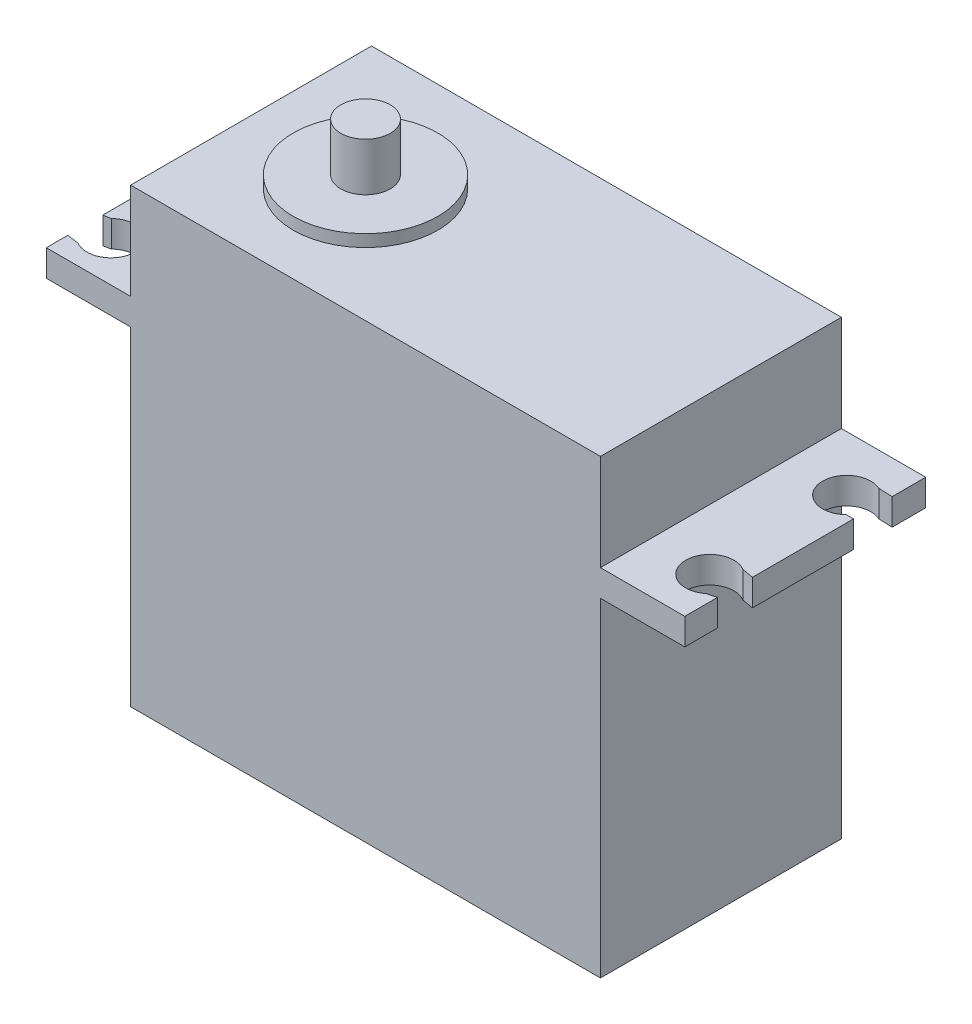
ISO-10303-21;
HEADER;
FILE_DESCRIPTION(('STEP AP214'),'2;1');
FILE_NAME('part.step','',(''),(''),'','','');
FILE_SCHEMA(('AUTOMOTIVE_DESIGN { 1 0 10303 214 1 1 1 1 }'));
ENDSEC;
DATA;
#1=APPLICATION_CONTEXT('core data for automotive mechanical design processes');
#2=APPLICATION_PROTOCOL_DEFINITION('international standard','automotive_design',2000,#1);
#3=PRODUCT_CONTEXT('',#1,'mechanical');
#4=PRODUCT('Part','Part','',(#3));
#5=PRODUCT_RELATED_PRODUCT_CATEGORY('part','',(#4));
#6=PRODUCT_DEFINITION_FORMATION('','',#4);
#7=PRODUCT_DEFINITION_CONTEXT('part definition',#1,'design');
#8=PRODUCT_DEFINITION('design','',#6,#7);
#9=PRODUCT_DEFINITION_SHAPE('','',#8);
#10=(LENGTH_UNIT() NAMED_UNIT(*) SI_UNIT(.MILLI.,.METRE.));
#11=(NAMED_UNIT(*) PLANE_ANGLE_UNIT() SI_UNIT($,.RADIAN.));
#12=(NAMED_UNIT(*) SI_UNIT($,.STERADIAN.) SOLID_ANGLE_UNIT());
#13=UNCERTAINTY_MEASURE_WITH_UNIT(LENGTH_MEASURE(1.E-05),#10,'distance_accuracy_value','');
#14=(GEOMETRIC_REPRESENTATION_CONTEXT(3) GLOBAL_UNCERTAINTY_ASSIGNED_CONTEXT((#13)) GLOBAL_UNIT_ASSIGNED_CONTEXT((#10,
#11,#12)) REPRESENTATION_CONTEXT('',''));
#15=CARTESIAN_POINT('',(0.,0.,0.));
#16=DIRECTION('',(0.,0.,1.));
#17=DIRECTION('',(1.,0.,0.));
#18=AXIS2_PLACEMENT_3D('',#15,#16,#17);
#19=CARTESIAN_POINT('',(30.8196202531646,0.,0.));
#20=DIRECTION('',(1.,0.,0.));
#21=DIRECTION('',(0.,0.,-1.));
#22=AXIS2_PLACEMENT_3D('',#19,#20,#21);
#23=PLANE('',#22);
#24=DIRECTION('',(0.,-1.,0.));
#25=VECTOR('',#24,1.);
#26=CARTESIAN_POINT('',(30.8196202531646,0.,5.73709977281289));
#27=LINE('',#26,#25);
#28=CARTESIAN_POINT('',(30.8196202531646,29.5,5.7370997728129));
#29=VERTEX_POINT('',#28);
#30=CARTESIAN_POINT('',(30.8196202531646,27.3,5.7370997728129));
#31=VERTEX_POINT('',#30);
#32=EDGE_CURVE('E304',#29,#31,#27,.T.);
#33=ORIENTED_EDGE('',*,*,#32,.F.);
#34=DIRECTION('',(0.,0.,1.));
#35=VECTOR('',#34,1.);
#36=CARTESIAN_POINT('',(30.8196202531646,29.5,8.45411392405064));
#37=LINE('',#36,#35);
#38=CARTESIAN_POINT('',(30.8196202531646,29.5,8.45411392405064));
#39=VERTEX_POINT('',#38);
#40=EDGE_CURVE('E317',#29,#39,#37,.T.);
#41=ORIENTED_EDGE('',*,*,#40,.T.);
#42=DIRECTION('',(0.,-1.,0.));
#43=VECTOR('',#42,1.);
#44=CARTESIAN_POINT('',(30.8196202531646,29.5,8.45411392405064));
#45=LINE('',#44,#43);
#46=CARTESIAN_POINT('',(30.8196202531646,27.3,8.45411392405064));
#47=VERTEX_POINT('',#46);
#48=EDGE_CURVE('E306',#39,#47,#45,.T.);
#49=ORIENTED_EDGE('',*,*,#48,.T.);
#50=DIRECTION('',(0.,0.,-1.));
#51=VECTOR('',#50,1.);
#52=CARTESIAN_POINT('',(30.8196202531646,27.3,8.45411392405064));
#53=LINE('',#52,#51);
#54=EDGE_CURVE('E310',#47,#31,#53,.T.);
#55=ORIENTED_EDGE('',*,*,#54,.T.);
#56=EDGE_LOOP('',(#33,#41,#49,#55));
#57=FACE_BOUND('',#56,.T.);
#58=ADVANCED_FACE('F33',(#57),#23,.T.);
#59=DIRECTION('',(0.,1.,0.));
#60=VECTOR('',#59,1.);
#61=CARTESIAN_POINT('',(30.8196202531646,0.,-8.76164008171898));
#62=LINE('',#61,#60);
#63=CARTESIAN_POINT('',(30.8196202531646,27.3,-8.76164008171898));
#64=VERTEX_POINT('',#63);
#65=CARTESIAN_POINT('',(30.8196202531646,29.5,-8.76164008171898));
#66=VERTEX_POINT('',#65);
#67=EDGE_CURVE('E293',#64,#66,#62,.T.);
#68=ORIENTED_EDGE('',*,*,#67,.F.);
#69=CARTESIAN_POINT('',(30.8196202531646,27.3,-11.5458860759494));
#70=VERTEX_POINT('',#69);
#71=EDGE_CURVE('E309',#64,#70,#53,.T.);
#72=ORIENTED_EDGE('',*,*,#71,.T.);
#73=DIRECTION('',(0.,1.,0.));
#74=VECTOR('',#73,1.);
#75=CARTESIAN_POINT('',(30.8196202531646,29.5,-11.5458860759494));
#76=LINE('',#75,#74);
#77=CARTESIAN_POINT('',(30.8196202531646,29.5,-11.5458860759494));
#78=VERTEX_POINT('',#77);
#79=EDGE_CURVE('E313',#70,#78,#76,.T.);
#80=ORIENTED_EDGE('',*,*,#79,.T.);
#81=EDGE_CURVE('E318',#78,#66,#37,.T.);
#82=ORIENTED_EDGE('',*,*,#81,.T.);
#83=EDGE_LOOP('',(#68,#72,#80,#82));
#84=FACE_BOUND('',#83,.T.);
#85=ADVANCED_FACE('F442',(#84),#23,.T.);
#86=CARTESIAN_POINT('',(-22.1803797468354,0.,0.));
#87=DIRECTION('',(1.,0.,0.));
#88=DIRECTION('',(0.,0.,-1.));
#89=AXIS2_PLACEMENT_3D('',#86,#87,#88);
#90=PLANE('',#89);
#91=DIRECTION('',(0.,0.,-1.));
#92=VECTOR('',#91,1.);
#93=CARTESIAN_POINT('',(-22.1803797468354,27.3,8.45411392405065));
#94=LINE('',#93,#92);
#95=CARTESIAN_POINT('',(-22.1803797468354,27.3,-8.6234085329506));
#96=VERTEX_POINT('',#95);
#97=CARTESIAN_POINT('',(-22.1803797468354,27.3,-11.5458860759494));
#98=VERTEX_POINT('',#97);
#99=EDGE_CURVE('E325',#96,#98,#94,.T.);
#100=ORIENTED_EDGE('',*,*,#99,.F.);
#101=DIRECTION('',(0.,1.,0.));
#102=VECTOR('',#101,1.);
#103=CARTESIAN_POINT('',(-22.1803797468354,0.,-8.6234085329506));
#104=LINE('',#103,#102);
#105=CARTESIAN_POINT('',(-22.1803797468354,29.5,-8.6234085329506));
#106=VERTEX_POINT('',#105);
#107=EDGE_CURVE('E408',#96,#106,#104,.T.);
#108=ORIENTED_EDGE('',*,*,#107,.T.);
#109=DIRECTION('',(0.,0.,1.));
#110=VECTOR('',#109,1.);
#111=CARTESIAN_POINT('',(-22.1803797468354,29.5,8.45411392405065));
#112=LINE('',#111,#110);
#113=CARTESIAN_POINT('',(-22.1803797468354,29.5,-11.5458860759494));
#114=VERTEX_POINT('',#113);
#115=EDGE_CURVE('E334',#114,#106,#112,.T.);
#116=ORIENTED_EDGE('',*,*,#115,.F.);
#117=DIRECTION('',(0.,1.,0.));
#118=VECTOR('',#117,1.);
#119=CARTESIAN_POINT('',(-22.1803797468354,29.5,-11.5458860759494));
#120=LINE('',#119,#118);
#121=EDGE_CURVE('E329',#98,#114,#120,.T.);
#122=ORIENTED_EDGE('',*,*,#121,.F.);
#123=EDGE_LOOP('',(#100,#108,#116,#122));
#124=FACE_BOUND('',#123,.T.);
#125=ADVANCED_FACE('F493',(#124),#90,.F.);
#126=CARTESIAN_POINT('',(-22.1803797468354,29.5,6.6663663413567));
#127=VERTEX_POINT('',#126);
#128=CARTESIAN_POINT('',(-22.1803797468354,29.5,8.45411392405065));
#129=VERTEX_POINT('',#128);
#130=EDGE_CURVE('E333',#127,#129,#112,.T.);
#131=ORIENTED_EDGE('',*,*,#130,.F.);
#132=DIRECTION('',(0.,-1.,0.));
#133=VECTOR('',#132,1.);
#134=CARTESIAN_POINT('',(-22.1803797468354,0.,6.6663663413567));
#135=LINE('',#134,#133);
#136=CARTESIAN_POINT('',(-22.1803797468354,27.3,6.6663663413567));
#137=VERTEX_POINT('',#136);
#138=EDGE_CURVE('E402',#127,#137,#135,.T.);
#139=ORIENTED_EDGE('',*,*,#138,.T.);
#140=CARTESIAN_POINT('',(-22.1803797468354,27.3,8.45411392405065));
#141=VERTEX_POINT('',#140);
#142=EDGE_CURVE('E326',#141,#137,#94,.T.);
#143=ORIENTED_EDGE('',*,*,#142,.F.);
#144=DIRECTION('',(0.,-1.,0.));
#145=VECTOR('',#144,1.);
#146=CARTESIAN_POINT('',(-22.1803797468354,29.5,8.45411392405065));
#147=LINE('',#146,#145);
#148=EDGE_CURVE('E321',#129,#141,#147,.T.);
#149=ORIENTED_EDGE('',*,*,#148,.F.);
#150=EDGE_LOOP('',(#131,#139,#143,#149));
#151=FACE_BOUND('',#150,.T.);
#152=ADVANCED_FACE('F530',(#151),#90,.F.);
#153=CARTESIAN_POINT('',(-15.1803797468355,37.5,-11.5458860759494));
#154=DIRECTION('',(1.,0.,0.));
#155=DIRECTION('',(0.,0.,-1.));
#156=AXIS2_PLACEMENT_3D('',#153,#154,#155);
#157=PLANE('',#156);
#158=DIRECTION('',(0.,-1.,0.));
#159=VECTOR('',#158,1.);
#160=CARTESIAN_POINT('',(-15.1803797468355,37.5,-11.5458860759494));
#161=LINE('',#160,#159);
#162=CARTESIAN_POINT('',(-15.1803797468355,37.5,-11.5458860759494));
#163=VERTEX_POINT('',#162);
#164=CARTESIAN_POINT('',(-15.1803797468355,29.5,-11.5458860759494));
#165=VERTEX_POINT('',#164);
#166=EDGE_CURVE('E385',#163,#165,#161,.T.);
#167=ORIENTED_EDGE('',*,*,#166,.T.);
#168=DIRECTION('',(0.,0.,1.));
#169=VECTOR('',#168,1.);
#170=CARTESIAN_POINT('',(-15.1803797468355,29.5,-11.5458860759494));
#171=LINE('',#170,#169);
#172=CARTESIAN_POINT('',(-15.1803797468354,29.5,8.45411392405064));
#173=VERTEX_POINT('',#172);
#174=EDGE_CURVE('E360',#165,#173,#171,.T.);
#175=ORIENTED_EDGE('',*,*,#174,.T.);
#176=DIRECTION('',(0.,-1.,0.));
#177=VECTOR('',#176,1.);
#178=CARTESIAN_POINT('',(-15.1803797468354,37.5,8.45411392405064));
#179=LINE('',#178,#177);
#180=CARTESIAN_POINT('',(-15.1803797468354,37.5,8.45411392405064));
#181=VERTEX_POINT('',#180);
#182=EDGE_CURVE('E397',#181,#173,#179,.T.);
#183=ORIENTED_EDGE('',*,*,#182,.F.);
#184=DIRECTION('',(0.,0.,1.));
#185=VECTOR('',#184,1.);
#186=CARTESIAN_POINT('',(-15.1803797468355,37.5,-11.5458860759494));
#187=LINE('',#186,#185);
#188=EDGE_CURVE('E364',#163,#181,#187,.T.);
#189=ORIENTED_EDGE('',*,*,#188,.F.);
#190=EDGE_LOOP('',(#167,#175,#183,#189));
#191=FACE_BOUND('',#190,.T.);
#192=ADVANCED_FACE('F524',(#191),#157,.F.);
#193=CARTESIAN_POINT('',(23.8196202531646,37.5,-11.5458860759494));
#194=DIRECTION('',(-1.,0.,0.));
#195=DIRECTION('',(0.,0.,1.));
#196=AXIS2_PLACEMENT_3D('',#193,#194,#195);
#197=PLANE('',#196);
#198=DIRECTION('',(0.,-1.,0.));
#199=VECTOR('',#198,1.);
#200=CARTESIAN_POINT('',(23.8196202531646,37.5,8.45411392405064));
#201=LINE('',#200,#199);
#202=CARTESIAN_POINT('',(23.8196202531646,37.5,8.45411392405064));
#203=VERTEX_POINT('',#202);
#204=CARTESIAN_POINT('',(23.8196202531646,29.5,8.45411392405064));
#205=VERTEX_POINT('',#204);
#206=EDGE_CURVE('E393',#203,#205,#201,.T.);
#207=ORIENTED_EDGE('',*,*,#206,.T.);
#208=DIRECTION('',(0.,0.,-1.));
#209=VECTOR('',#208,1.);
#210=CARTESIAN_POINT('',(23.8196202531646,29.5,-11.5458860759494));
#211=LINE('',#210,#209);
#212=CARTESIAN_POINT('',(23.8196202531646,29.5,-11.5458860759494));
#213=VERTEX_POINT('',#212);
#214=EDGE_CURVE('E357',#205,#213,#211,.T.);
#215=ORIENTED_EDGE('',*,*,#214,.T.);
#216=DIRECTION('',(0.,-1.,0.));
#217=VECTOR('',#216,1.);
#218=CARTESIAN_POINT('',(23.8196202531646,37.5,-11.5458860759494));
#219=LINE('',#218,#217);
#220=CARTESIAN_POINT('',(23.8196202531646,37.5,-11.5458860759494));
#221=VERTEX_POINT('',#220);
#222=EDGE_CURVE('E389',#221,#213,#219,.T.);
#223=ORIENTED_EDGE('',*,*,#222,.F.);
#224=DIRECTION('',(0.,0.,-1.));
#225=VECTOR('',#224,1.);
#226=CARTESIAN_POINT('',(23.8196202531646,37.5,-11.5458860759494));
#227=LINE('',#226,#225);
#228=EDGE_CURVE('E370',#203,#221,#227,.T.);
#229=ORIENTED_EDGE('',*,*,#228,.F.);
#230=EDGE_LOOP('',(#207,#215,#223,#229));
#231=FACE_BOUND('',#230,.T.);
#232=ADVANCED_FACE('F456',(#231),#197,.F.);
#233=CARTESIAN_POINT('',(-15.1803797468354,27.3,8.45411392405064));
#234=VERTEX_POINT('',#233);
#235=CARTESIAN_POINT('',(-15.1803797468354,0.,8.45411392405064));
#236=VERTEX_POINT('',#235);
#237=EDGE_CURVE('E396',#234,#236,#179,.T.);
#238=ORIENTED_EDGE('',*,*,#237,.F.);
#239=DIRECTION('',(0.,0.,-1.));
#240=VECTOR('',#239,1.);
#241=CARTESIAN_POINT('',(-15.1803797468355,27.3,-11.5458860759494));
#242=LINE('',#241,#240);
#243=CARTESIAN_POINT('',(-15.1803797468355,27.3,-11.5458860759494));
#244=VERTEX_POINT('',#243);
#245=EDGE_CURVE('E354',#234,#244,#242,.T.);
#246=ORIENTED_EDGE('',*,*,#245,.T.);
#247=CARTESIAN_POINT('',(-15.1803797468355,0.,-11.5458860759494));
#248=VERTEX_POINT('',#247);
#249=EDGE_CURVE('E374',#244,#248,#161,.T.);
#250=ORIENTED_EDGE('',*,*,#249,.T.);
#251=DIRECTION('',(0.,0.,1.));
#252=VECTOR('',#251,1.);
#253=CARTESIAN_POINT('',(-15.1803797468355,0.,-11.5458860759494));
#254=LINE('',#253,#252);
#255=EDGE_CURVE('E363',#248,#236,#254,.T.);
#256=ORIENTED_EDGE('',*,*,#255,.T.);
#257=EDGE_LOOP('',(#238,#246,#250,#256));
#258=FACE_BOUND('',#257,.T.);
#259=ADVANCED_FACE('F35',(#258),#157,.F.);
#260=CARTESIAN_POINT('',(-15.1803797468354,37.5,8.45411392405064));
#261=DIRECTION('',(0.,0.,-1.));
#262=DIRECTION('',(-1.,0.,0.));
#263=AXIS2_PLACEMENT_3D('',#260,#261,#262);
#264=PLANE('',#263);
#265=CARTESIAN_POINT('',(23.8196202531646,27.3,8.45411392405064));
#266=VERTEX_POINT('',#265);
#267=CARTESIAN_POINT('',(23.8196202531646,0.,8.45411392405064));
#268=VERTEX_POINT('',#267);
#269=EDGE_CURVE('E392',#266,#268,#201,.T.);
#270=ORIENTED_EDGE('',*,*,#269,.F.);
#271=DIRECTION('',(1.,0.,0.));
#272=VECTOR('',#271,1.);
#273=CARTESIAN_POINT('',(-22.1803797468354,27.3,8.45411392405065));
#274=LINE('',#273,#272);
#275=EDGE_CURVE('E337',#266,#47,#274,.T.);
#276=ORIENTED_EDGE('',*,*,#275,.T.);
#277=ORIENTED_EDGE('',*,*,#48,.F.);
#278=DIRECTION('',(1.,0.,0.));
#279=VECTOR('',#278,1.);
#280=CARTESIAN_POINT('',(-22.1803797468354,29.5,8.45411392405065));
#281=LINE('',#280,#279);
#282=EDGE_CURVE('E341',#205,#39,#281,.T.);
#283=ORIENTED_EDGE('',*,*,#282,.F.);
#284=ORIENTED_EDGE('',*,*,#206,.F.);
#285=DIRECTION('',(1.,0.,0.));
#286=VECTOR('',#285,1.);
#287=CARTESIAN_POINT('',(-15.1803797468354,37.5,8.45411392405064));
#288=LINE('',#287,#286);
#289=EDGE_CURVE('E367',#181,#203,#288,.T.);
#290=ORIENTED_EDGE('',*,*,#289,.F.);
#291=ORIENTED_EDGE('',*,*,#182,.T.);
#292=EDGE_CURVE('E338',#129,#173,#281,.T.);
#293=ORIENTED_EDGE('',*,*,#292,.F.);
#294=ORIENTED_EDGE('',*,*,#148,.T.);
#295=EDGE_CURVE('E349',#141,#234,#274,.T.);
#296=ORIENTED_EDGE('',*,*,#295,.T.);
#297=ORIENTED_EDGE('',*,*,#237,.T.);
#298=DIRECTION('',(1.,0.,0.));
#299=VECTOR('',#298,1.);
#300=CARTESIAN_POINT('',(-15.1803797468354,0.,8.45411392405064));
#301=LINE('',#300,#299);
#302=EDGE_CURVE('E377',#236,#268,#301,.T.);
#303=ORIENTED_EDGE('',*,*,#302,.T.);
#304=EDGE_LOOP('',(#270,#276,#277,#283,#284,#290,#291,#293,#294,#296,#297,#303));
#305=FACE_BOUND('',#304,.T.);
#306=ADVANCED_FACE('F461',(#305),#264,.F.);
#307=CARTESIAN_POINT('',(23.8196202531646,27.3,-11.5458860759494));
#308=VERTEX_POINT('',#307);
#309=CARTESIAN_POINT('',(23.8196202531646,0.,-11.5458860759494));
#310=VERTEX_POINT('',#309);
#311=EDGE_CURVE('E388',#308,#310,#219,.T.);
#312=ORIENTED_EDGE('',*,*,#311,.F.);
#313=DIRECTION('',(0.,0.,1.));
#314=VECTOR('',#313,1.);
#315=CARTESIAN_POINT('',(23.8196202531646,27.3,-11.5458860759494));
#316=LINE('',#315,#314);
#317=EDGE_CURVE('E340',#308,#266,#316,.T.);
#318=ORIENTED_EDGE('',*,*,#317,.T.);
#319=ORIENTED_EDGE('',*,*,#269,.T.);
#320=DIRECTION('',(0.,0.,-1.));
#321=VECTOR('',#320,1.);
#322=CARTESIAN_POINT('',(23.8196202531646,0.,-11.5458860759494));
#323=LINE('',#322,#321);
#324=EDGE_CURVE('E380',#268,#310,#323,.T.);
#325=ORIENTED_EDGE('',*,*,#324,.T.);
#326=EDGE_LOOP('',(#312,#318,#319,#325));
#327=FACE_BOUND('',#326,.T.);
#328=ADVANCED_FACE('F516',(#327),#197,.F.);
#329=CARTESIAN_POINT('',(-15.1803797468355,37.5,-11.5458860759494));
#330=DIRECTION('',(0.,0.,1.));
#331=DIRECTION('',(1.,0.,0.));
#332=AXIS2_PLACEMENT_3D('',#329,#330,#331);
#333=PLANE('',#332);
#334=ORIENTED_EDGE('',*,*,#249,.F.);
#335=DIRECTION('',(1.,0.,0.));
#336=VECTOR('',#335,1.);
#337=CARTESIAN_POINT('',(-22.1803797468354,27.3,-11.5458860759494));
#338=LINE('',#337,#336);
#339=EDGE_CURVE('E346',#98,#244,#338,.T.);
#340=ORIENTED_EDGE('',*,*,#339,.F.);
#341=ORIENTED_EDGE('',*,*,#121,.T.);
#342=DIRECTION('',(1.,0.,0.));
#343=VECTOR('',#342,1.);
#344=CARTESIAN_POINT('',(-22.1803797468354,29.5,-11.5458860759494));
#345=LINE('',#344,#343);
#346=EDGE_CURVE('E342',#114,#165,#345,.T.);
#347=ORIENTED_EDGE('',*,*,#346,.T.);
#348=ORIENTED_EDGE('',*,*,#166,.F.);
#349=DIRECTION('',(-1.,0.,0.));
#350=VECTOR('',#349,1.);
#351=CARTESIAN_POINT('',(-15.1803797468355,37.5,-11.5458860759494));
#352=LINE('',#351,#350);
#353=EDGE_CURVE('E372',#221,#163,#352,.T.);
#354=ORIENTED_EDGE('',*,*,#353,.F.);
#355=ORIENTED_EDGE('',*,*,#222,.T.);
#356=EDGE_CURVE('E345',#213,#78,#345,.T.);
#357=ORIENTED_EDGE('',*,*,#356,.T.);
#358=ORIENTED_EDGE('',*,*,#79,.F.);
#359=EDGE_CURVE('E348',#308,#70,#338,.T.);
#360=ORIENTED_EDGE('',*,*,#359,.F.);
#361=ORIENTED_EDGE('',*,*,#311,.T.);
#362=DIRECTION('',(-1.,0.,0.));
#363=VECTOR('',#362,1.);
#364=CARTESIAN_POINT('',(-15.1803797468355,0.,-11.5458860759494));
#365=LINE('',#364,#363);
#366=EDGE_CURVE('E368',#310,#248,#365,.T.);
#367=ORIENTED_EDGE('',*,*,#366,.T.);
#368=EDGE_LOOP('',(#334,#340,#341,#347,#348,#354,#355,#357,#358,#360,#361,#367));
#369=FACE_BOUND('',#368,.T.);
#370=ADVANCED_FACE('F450',(#369),#333,.F.);
#371=CARTESIAN_POINT('',(0.,37.5,0.));
#372=DIRECTION('',(0.,1.,0.));
#373=DIRECTION('',(0.,0.,1.));
#374=AXIS2_PLACEMENT_3D('',#371,#372,#373);
#375=PLANE('',#374);
#376=CARTESIAN_POINT('',(-5.18037974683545,37.5,-1.04588607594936));
#377=DIRECTION('',(0.,1.,0.));
#378=DIRECTION('',(0.,0.,1.));
#379=AXIS2_PLACEMENT_3D('',#376,#377,#378);
#380=CIRCLE('',#379,6.);
#381=CARTESIAN_POINT('',(-5.18037974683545,37.5,4.95411392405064));
#382=VERTEX_POINT('',#381);
#383=EDGE_CURVE('E695',#382,#382,#380,.T.);
#384=ORIENTED_EDGE('',*,*,#383,.F.);
#385=EDGE_LOOP('',(#384));
#386=FACE_BOUND('',#385,.T.);
#387=ORIENTED_EDGE('',*,*,#188,.T.);
#388=ORIENTED_EDGE('',*,*,#289,.T.);
#389=ORIENTED_EDGE('',*,*,#228,.T.);
#390=ORIENTED_EDGE('',*,*,#353,.T.);
#391=EDGE_LOOP('',(#387,#388,#389,#390));
#392=FACE_BOUND('',#391,.T.);
#393=ADVANCED_FACE('F504',(#386,#392),#375,.T.);
#394=CARTESIAN_POINT('',(0.,0.,0.));
#395=DIRECTION('',(0.,1.,0.));
#396=DIRECTION('',(0.,0.,1.));
#397=AXIS2_PLACEMENT_3D('',#394,#395,#396);
#398=PLANE('',#397);
#399=ORIENTED_EDGE('',*,*,#255,.F.);
#400=ORIENTED_EDGE('',*,*,#366,.F.);
#401=ORIENTED_EDGE('',*,*,#324,.F.);
#402=ORIENTED_EDGE('',*,*,#302,.F.);
#403=EDGE_LOOP('',(#399,#400,#401,#402));
#404=FACE_BOUND('',#403,.T.);
#405=ADVANCED_FACE('F497',(#404),#398,.F.);
#406=DIRECTION('',(0.,1.,0.));
#407=VECTOR('',#406,1.);
#408=CARTESIAN_POINT('',(30.8196202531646,0.,2.83618720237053));
#409=LINE('',#408,#407);
#410=CARTESIAN_POINT('',(30.8196202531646,27.3,2.83618720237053));
#411=VERTEX_POINT('',#410);
#412=CARTESIAN_POINT('',(30.8196202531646,29.5,2.83618720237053));
#413=VERTEX_POINT('',#412);
#414=EDGE_CURVE('E56',#411,#413,#409,.T.);
#415=ORIENTED_EDGE('',*,*,#414,.F.);
#416=CARTESIAN_POINT('',(30.8196202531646,27.3,-5.56074359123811));
#417=VERTEX_POINT('',#416);
#418=EDGE_CURVE('E314',#411,#417,#53,.T.);
#419=ORIENTED_EDGE('',*,*,#418,.T.);
#420=DIRECTION('',(0.,-1.,0.));
#421=VECTOR('',#420,1.);
#422=CARTESIAN_POINT('',(30.8196202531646,0.,-5.56074359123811));
#423=LINE('',#422,#421);
#424=CARTESIAN_POINT('',(30.8196202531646,29.5,-5.56074359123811));
#425=VERTEX_POINT('',#424);
#426=EDGE_CURVE('E289',#425,#417,#423,.T.);
#427=ORIENTED_EDGE('',*,*,#426,.F.);
#428=EDGE_CURVE('E322',#425,#413,#37,.T.);
#429=ORIENTED_EDGE('',*,*,#428,.T.);
#430=EDGE_LOOP('',(#415,#419,#427,#429));
#431=FACE_BOUND('',#430,.T.);
#432=ADVANCED_FACE('F435',(#431),#23,.T.);
#433=CARTESIAN_POINT('',(-22.1803797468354,27.3,8.45411392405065));
#434=DIRECTION('',(0.,-1.,0.));
#435=DIRECTION('',(0.,0.,-1.));
#436=AXIS2_PLACEMENT_3D('',#433,#434,#435);
#437=PLANE('',#436);
#438=DIRECTION('',(-0.968032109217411,0.,0.250826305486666));
#439=VECTOR('',#438,1.);
#440=CARTESIAN_POINT('',(-19.5056590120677,27.3,18.7768571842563));
#441=LINE('',#440,#439);
#442=CARTESIAN_POINT('',(30.0828441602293,27.3,5.92800545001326));
#443=VERTEX_POINT('',#442);
#444=EDGE_CURVE('E302',#31,#443,#441,.T.);
#445=ORIENTED_EDGE('',*,*,#444,.F.);
#446=ORIENTED_EDGE('',*,*,#54,.F.);
#447=ORIENTED_EDGE('',*,*,#275,.F.);
#448=ORIENTED_EDGE('',*,*,#317,.F.);
#449=ORIENTED_EDGE('',*,*,#359,.T.);
#450=ORIENTED_EDGE('',*,*,#71,.F.);
#451=DIRECTION('',(0.999435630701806,0.,0.0335919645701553));
#452=VECTOR('',#451,1.);
#453=CARTESIAN_POINT('',(-21.5425888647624,27.3,-10.5215828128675));
#454=LINE('',#453,#452);
#455=CARTESIAN_POINT('',(29.6674665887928,27.3,-8.80036504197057));
#456=VERTEX_POINT('',#455);
#457=EDGE_CURVE('E291',#456,#64,#454,.T.);
#458=ORIENTED_EDGE('',*,*,#457,.F.);
#459=CARTESIAN_POINT('',(28.8196202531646,27.3,-6.98896873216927));
#460=DIRECTION('',(0.,-1.,0.));
#461=DIRECTION('',(0.,0.,-1.));
#462=AXIS2_PLACEMENT_3D('',#459,#460,#461);
#463=CIRCLE('',#462,2.);
#464=CARTESIAN_POINT('',(30.2196820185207,27.3,-5.56074359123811));
#465=VERTEX_POINT('',#464);
#466=EDGE_CURVE('E295',#465,#456,#463,.T.);
#467=ORIENTED_EDGE('',*,*,#466,.F.);
#468=DIRECTION('',(-1.,0.,0.));
#469=VECTOR('',#468,1.);
#470=CARTESIAN_POINT('',(-22.1803797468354,27.3,-5.56074359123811));
#471=LINE('',#470,#469);
#472=EDGE_CURVE('E287',#417,#465,#471,.T.);
#473=ORIENTED_EDGE('',*,*,#472,.F.);
#474=ORIENTED_EDGE('',*,*,#418,.F.);
#475=DIRECTION('',(0.984792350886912,0.,0.17373550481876));
#476=VECTOR('',#475,1.);
#477=CARTESIAN_POINT('',(-19.6194362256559,27.3,-6.06219115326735));
#478=LINE('',#477,#476);
#479=CARTESIAN_POINT('',(29.854325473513,27.3,2.66589142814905));
#480=VERTEX_POINT('',#479);
#481=EDGE_CURVE('E297',#480,#411,#478,.T.);
#482=ORIENTED_EDGE('',*,*,#481,.F.);
#483=CARTESIAN_POINT('',(28.8196202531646,27.3,4.37743608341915));
#484=DIRECTION('',(0.,-1.,0.));
#485=DIRECTION('',(0.,0.,-1.));
#486=AXIS2_PLACEMENT_3D('',#483,#484,#485);
#487=CIRCLE('',#486,2.);
#488=EDGE_CURVE('E300',#443,#480,#487,.T.);
#489=ORIENTED_EDGE('',*,*,#488,.F.);
#490=EDGE_LOOP('',(#445,#446,#447,#448,#449,#450,#458,#467,#473,#474,#482,#489));
#491=FACE_BOUND('',#490,.T.);
#492=ADVANCED_FACE('F446',(#491),#437,.T.);
#493=CARTESIAN_POINT('',(-22.1803797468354,29.5,8.45411392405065));
#494=DIRECTION('',(0.,1.,0.));
#495=DIRECTION('',(0.,0.,1.));
#496=AXIS2_PLACEMENT_3D('',#493,#494,#495);
#497=PLANE('',#496);
#498=DIRECTION('',(0.968032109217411,0.,-0.250826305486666));
#499=VECTOR('',#498,1.);
#500=CARTESIAN_POINT('',(32.8584890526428,29.5,5.20880951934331));
#501=LINE('',#500,#499);
#502=CARTESIAN_POINT('',(30.0828441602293,29.5,5.92800545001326));
#503=VERTEX_POINT('',#502);
#504=EDGE_CURVE('E256',#503,#29,#501,.T.);
#505=ORIENTED_EDGE('',*,*,#504,.F.);
#506=CARTESIAN_POINT('',(28.8196202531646,29.5,4.37743608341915));
#507=DIRECTION('',(0.,1.,0.));
#508=DIRECTION('',(0.,0.,1.));
#509=AXIS2_PLACEMENT_3D('',#506,#507,#508);
#510=CIRCLE('',#509,2.);
#511=CARTESIAN_POINT('',(29.854325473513,29.5,2.66589142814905));
#512=VERTEX_POINT('',#511);
#513=EDGE_CURVE('E253',#512,#503,#510,.T.);
#514=ORIENTED_EDGE('',*,*,#513,.F.);
#515=DIRECTION('',(-0.984792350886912,0.,-0.17373550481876));
#516=VECTOR('',#515,1.);
#517=CARTESIAN_POINT('',(-19.6194362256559,29.5,-6.06219115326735));
#518=LINE('',#517,#516);
#519=EDGE_CURVE('E11',#413,#512,#518,.T.);
#520=ORIENTED_EDGE('',*,*,#519,.F.);
#521=ORIENTED_EDGE('',*,*,#428,.F.);
#522=DIRECTION('',(1.,0.,0.));
#523=VECTOR('',#522,1.);
#524=CARTESIAN_POINT('',(30.2196820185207,29.5,-5.56074359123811));
#525=LINE('',#524,#523);
#526=CARTESIAN_POINT('',(30.2196820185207,29.5,-5.56074359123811));
#527=VERTEX_POINT('',#526);
#528=EDGE_CURVE('E274',#527,#425,#525,.T.);
#529=ORIENTED_EDGE('',*,*,#528,.F.);
#530=CARTESIAN_POINT('',(28.8196202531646,29.5,-6.98896873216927));
#531=DIRECTION('',(0.,1.,0.));
#532=DIRECTION('',(0.,0.,1.));
#533=AXIS2_PLACEMENT_3D('',#530,#531,#532);
#534=CIRCLE('',#533,2.);
#535=CARTESIAN_POINT('',(29.6674665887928,29.5,-8.80036504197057));
#536=VERTEX_POINT('',#535);
#537=EDGE_CURVE('E49',#536,#527,#534,.T.);
#538=ORIENTED_EDGE('',*,*,#537,.F.);
#539=DIRECTION('',(-0.999435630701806,0.,-0.0335919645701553));
#540=VECTOR('',#539,1.);
#541=CARTESIAN_POINT('',(-21.5425888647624,29.5,-10.5215828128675));
#542=LINE('',#541,#540);
#543=EDGE_CURVE('E42',#66,#536,#542,.T.);
#544=ORIENTED_EDGE('',*,*,#543,.F.);
#545=ORIENTED_EDGE('',*,*,#81,.F.);
#546=ORIENTED_EDGE('',*,*,#356,.F.);
#547=ORIENTED_EDGE('',*,*,#214,.F.);
#548=ORIENTED_EDGE('',*,*,#282,.T.);
#549=ORIENTED_EDGE('',*,*,#40,.F.);
#550=EDGE_LOOP('',(#505,#514,#520,#521,#529,#538,#544,#545,#546,#547,#548,#549));
#551=FACE_BOUND('',#550,.T.);
#552=ADVANCED_FACE('F426',(#551),#497,.T.);
#553=DIRECTION('',(-0.995803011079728,0.,0.0915224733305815));
#554=VECTOR('',#553,1.);
#555=CARTESIAN_POINT('',(-25.609138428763,29.5,-8.30827745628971));
#556=LINE('',#555,#554);
#557=CARTESIAN_POINT('',(-21.1920195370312,29.5,-8.71424695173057));
#558=VERTEX_POINT('',#557);
#559=EDGE_CURVE('E251',#558,#106,#556,.T.);
#560=ORIENTED_EDGE('',*,*,#559,.F.);
#561=CARTESIAN_POINT('',(-20.1803797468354,29.5,-6.98896873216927));
#562=DIRECTION('',(0.,1.,0.));
#563=DIRECTION('',(0.,0.,1.));
#564=AXIS2_PLACEMENT_3D('',#561,#562,#563);
#565=CIRCLE('',#564,2.);
#566=CARTESIAN_POINT('',(-21.5804415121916,29.5,-5.56074359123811));
#567=VERTEX_POINT('',#566);
#568=EDGE_CURVE('E267',#567,#558,#565,.T.);
#569=ORIENTED_EDGE('',*,*,#568,.F.);
#570=DIRECTION('',(0.978846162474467,0.,0.204597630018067));
#571=VECTOR('',#570,1.);
#572=CARTESIAN_POINT('',(-25.609138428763,29.5,-6.40281854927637));
#573=LINE('',#572,#571);
#574=CARTESIAN_POINT('',(-22.1803797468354,29.5,-5.68614219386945));
#575=VERTEX_POINT('',#574);
#576=EDGE_CURVE('E264',#575,#567,#573,.T.);
#577=ORIENTED_EDGE('',*,*,#576,.F.);
#578=CARTESIAN_POINT('',(-22.1803797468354,29.5,3.76309111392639));
#579=VERTEX_POINT('',#578);
#580=EDGE_CURVE('E246',#575,#579,#112,.T.);
#581=ORIENTED_EDGE('',*,*,#580,.T.);
#582=DIRECTION('',(-0.984324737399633,0.,0.176365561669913));
#583=VECTOR('',#582,1.);
#584=CARTESIAN_POINT('',(-21.5804415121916,29.5,3.6555976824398));
#585=LINE('',#584,#583);
#586=CARTESIAN_POINT('',(-21.5804415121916,29.5,3.6555976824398));
#587=VERTEX_POINT('',#586);
#588=EDGE_CURVE('E223',#587,#579,#585,.T.);
#589=ORIENTED_EDGE('',*,*,#588,.F.);
#590=CARTESIAN_POINT('',(-20.1803797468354,29.5,5.08382282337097));
#591=DIRECTION('',(0.,1.,0.));
#592=DIRECTION('',(0.,0.,1.));
#593=AXIS2_PLACEMENT_3D('',#590,#591,#592);
#594=CIRCLE('',#593,2.);
#595=CARTESIAN_POINT('',(-21.1920195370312,29.5,6.80910104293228));
#596=VERTEX_POINT('',#595);
#597=EDGE_CURVE('E233',#596,#587,#594,.T.);
#598=ORIENTED_EDGE('',*,*,#597,.F.);
#599=DIRECTION('',(0.989732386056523,0.,0.142932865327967));
#600=VECTOR('',#599,1.);
#601=CARTESIAN_POINT('',(-25.609138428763,29.5,6.17119986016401));
#602=LINE('',#601,#600);
#603=EDGE_CURVE('E230',#127,#596,#602,.T.);
#604=ORIENTED_EDGE('',*,*,#603,.F.);
#605=ORIENTED_EDGE('',*,*,#130,.T.);
#606=ORIENTED_EDGE('',*,*,#292,.T.);
#607=ORIENTED_EDGE('',*,*,#174,.F.);
#608=ORIENTED_EDGE('',*,*,#346,.F.);
#609=ORIENTED_EDGE('',*,*,#115,.T.);
#610=EDGE_LOOP('',(#560,#569,#577,#581,#589,#598,#604,#605,#606,#607,#608,#609));
#611=FACE_BOUND('',#610,.T.);
#612=ADVANCED_FACE('F243',(#611),#497,.T.);
#613=DIRECTION('',(0.995803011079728,0.,-0.0915224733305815));
#614=VECTOR('',#613,1.);
#615=CARTESIAN_POINT('',(-23.7367970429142,27.3,-8.48036100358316));
#616=LINE('',#615,#614);
#617=CARTESIAN_POINT('',(-21.1920195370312,27.3,-8.71424695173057));
#618=VERTEX_POINT('',#617);
#619=EDGE_CURVE('E285',#96,#618,#616,.T.);
#620=ORIENTED_EDGE('',*,*,#619,.F.);
#621=ORIENTED_EDGE('',*,*,#99,.T.);
#622=ORIENTED_EDGE('',*,*,#339,.T.);
#623=ORIENTED_EDGE('',*,*,#245,.F.);
#624=ORIENTED_EDGE('',*,*,#295,.F.);
#625=ORIENTED_EDGE('',*,*,#142,.T.);
#626=DIRECTION('',(-0.989732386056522,0.,-0.142932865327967));
#627=VECTOR('',#626,1.);
#628=CARTESIAN_POINT('',(-21.9274755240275,27.3,6.70288967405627));
#629=LINE('',#628,#627);
#630=CARTESIAN_POINT('',(-21.1920195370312,27.3,6.80910104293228));
#631=VERTEX_POINT('',#630);
#632=EDGE_CURVE('E281',#631,#137,#629,.T.);
#633=ORIENTED_EDGE('',*,*,#632,.F.);
#634=CARTESIAN_POINT('',(-20.1803797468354,27.3,5.08382282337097));
#635=DIRECTION('',(0.,-1.,0.));
#636=DIRECTION('',(0.,0.,-1.));
#637=AXIS2_PLACEMENT_3D('',#634,#635,#636);
#638=CIRCLE('',#637,2.);
#639=CARTESIAN_POINT('',(-21.5804415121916,27.3,3.6555976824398));
#640=VERTEX_POINT('',#639);
#641=EDGE_CURVE('E411',#640,#631,#638,.T.);
#642=ORIENTED_EDGE('',*,*,#641,.F.);
#643=DIRECTION('',(0.984324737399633,0.,-0.176365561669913));
#644=VECTOR('',#643,1.);
#645=CARTESIAN_POINT('',(-22.9947459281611,27.3,3.90900449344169));
#646=LINE('',#645,#644);
#647=CARTESIAN_POINT('',(-22.1803797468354,27.3,3.76309111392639));
#648=VERTEX_POINT('',#647);
#649=EDGE_CURVE('E226',#648,#640,#646,.T.);
#650=ORIENTED_EDGE('',*,*,#649,.F.);
#651=CARTESIAN_POINT('',(-22.1803797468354,27.3,-5.68614219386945));
#652=VERTEX_POINT('',#651);
#653=EDGE_CURVE('E330',#648,#652,#94,.T.);
#654=ORIENTED_EDGE('',*,*,#653,.T.);
#655=DIRECTION('',(-0.978846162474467,0.,-0.204597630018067));
#656=VECTOR('',#655,1.);
#657=CARTESIAN_POINT('',(-19.3485162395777,27.3,-5.09422838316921));
#658=LINE('',#657,#656);
#659=CARTESIAN_POINT('',(-21.5804415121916,27.3,-5.56074359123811));
#660=VERTEX_POINT('',#659);
#661=EDGE_CURVE('E283',#660,#652,#658,.T.);
#662=ORIENTED_EDGE('',*,*,#661,.F.);
#663=CARTESIAN_POINT('',(-20.1803797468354,27.3,-6.98896873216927));
#664=DIRECTION('',(0.,-1.,0.));
#665=DIRECTION('',(0.,0.,-1.));
#666=AXIS2_PLACEMENT_3D('',#663,#664,#665);
#667=CIRCLE('',#666,2.);
#668=EDGE_CURVE('E413',#618,#660,#667,.T.);
#669=ORIENTED_EDGE('',*,*,#668,.F.);
#670=EDGE_LOOP('',(#620,#621,#622,#623,#624,#625,#633,#642,#650,#654,#662,#669));
#671=FACE_BOUND('',#670,.T.);
#672=ADVANCED_FACE('F503',(#671),#437,.T.);
#673=ORIENTED_EDGE('',*,*,#580,.F.);
#674=DIRECTION('',(0.,-1.,0.));
#675=VECTOR('',#674,1.);
#676=CARTESIAN_POINT('',(-22.1803797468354,0.,-5.68614219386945));
#677=LINE('',#676,#675);
#678=EDGE_CURVE('E405',#575,#652,#677,.T.);
#679=ORIENTED_EDGE('',*,*,#678,.T.);
#680=ORIENTED_EDGE('',*,*,#653,.F.);
#681=DIRECTION('',(0.,1.,0.));
#682=VECTOR('',#681,1.);
#683=CARTESIAN_POINT('',(-22.1803797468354,0.,3.76309111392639));
#684=LINE('',#683,#682);
#685=EDGE_CURVE('E400',#648,#579,#684,.T.);
#686=ORIENTED_EDGE('',*,*,#685,.T.);
#687=EDGE_LOOP('',(#673,#679,#680,#686));
#688=FACE_BOUND('',#687,.T.);
#689=ADVANCED_FACE('F536',(#688),#90,.F.);
#690=CARTESIAN_POINT('',(-20.1803797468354,22.5,5.08382282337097));
#691=DIRECTION('',(0.,1.,0.));
#692=DIRECTION('',(0.,0.,1.));
#693=AXIS2_PLACEMENT_3D('',#690,#691,#692);
#694=CYLINDRICAL_SURFACE('',#693,2.);
#695=ORIENTED_EDGE('',*,*,#641,.T.);
#696=DIRECTION('',(0.,1.,0.));
#697=VECTOR('',#696,1.);
#698=CARTESIAN_POINT('',(-21.1920195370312,22.5,6.80910104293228));
#699=LINE('',#698,#697);
#700=EDGE_CURVE('E229',#631,#596,#699,.T.);
#701=ORIENTED_EDGE('',*,*,#700,.T.);
#702=ORIENTED_EDGE('',*,*,#597,.T.);
#703=DIRECTION('',(0.,1.,0.));
#704=VECTOR('',#703,1.);
#705=CARTESIAN_POINT('',(-21.5804415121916,22.5,3.6555976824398));
#706=LINE('',#705,#704);
#707=EDGE_CURVE('E219',#640,#587,#706,.T.);
#708=ORIENTED_EDGE('',*,*,#707,.F.);
#709=EDGE_LOOP('',(#695,#701,#702,#708));
#710=FACE_BOUND('',#709,.T.);
#711=ADVANCED_FACE('F234',(#710),#694,.F.);
#712=CARTESIAN_POINT('',(-25.609138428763,22.5,6.17119986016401));
#713=DIRECTION('',(-0.142932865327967,0.,0.989732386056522));
#714=DIRECTION('',(0.989732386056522,0.,0.142932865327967));
#715=AXIS2_PLACEMENT_3D('',#712,#713,#714);
#716=PLANE('',#715);
#717=ORIENTED_EDGE('',*,*,#632,.T.);
#718=ORIENTED_EDGE('',*,*,#138,.F.);
#719=ORIENTED_EDGE('',*,*,#603,.T.);
#720=ORIENTED_EDGE('',*,*,#700,.F.);
#721=EDGE_LOOP('',(#717,#718,#719,#720));
#722=FACE_BOUND('',#721,.T.);
#723=ADVANCED_FACE('F570',(#722),#716,.F.);
#724=CARTESIAN_POINT('',(-21.5804415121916,22.5,3.6555976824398));
#725=DIRECTION('',(-0.176365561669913,0.,-0.984324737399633));
#726=DIRECTION('',(-0.984324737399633,0.,0.176365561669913));
#727=AXIS2_PLACEMENT_3D('',#724,#725,#726);
#728=PLANE('',#727);
#729=ORIENTED_EDGE('',*,*,#649,.T.);
#730=ORIENTED_EDGE('',*,*,#707,.T.);
#731=ORIENTED_EDGE('',*,*,#588,.T.);
#732=ORIENTED_EDGE('',*,*,#685,.F.);
#733=EDGE_LOOP('',(#729,#730,#731,#732));
#734=FACE_BOUND('',#733,.T.);
#735=ADVANCED_FACE('F221',(#734),#728,.F.);
#736=CARTESIAN_POINT('',(-25.609138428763,22.5,-8.30827745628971));
#737=DIRECTION('',(-0.0915224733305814,0.,-0.995803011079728));
#738=DIRECTION('',(-0.995803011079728,0.,0.0915224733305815));
#739=AXIS2_PLACEMENT_3D('',#736,#737,#738);
#740=PLANE('',#739);
#741=ORIENTED_EDGE('',*,*,#619,.T.);
#742=DIRECTION('',(0.,1.,0.));
#743=VECTOR('',#742,1.);
#744=CARTESIAN_POINT('',(-21.1920195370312,22.5,-8.71424695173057));
#745=LINE('',#744,#743);
#746=EDGE_CURVE('E257',#618,#558,#745,.T.);
#747=ORIENTED_EDGE('',*,*,#746,.T.);
#748=ORIENTED_EDGE('',*,*,#559,.T.);
#749=ORIENTED_EDGE('',*,*,#107,.F.);
#750=EDGE_LOOP('',(#741,#747,#748,#749));
#751=FACE_BOUND('',#750,.T.);
#752=ADVANCED_FACE('F556',(#751),#740,.F.);
#753=CARTESIAN_POINT('',(-20.1803797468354,22.5,-6.98896873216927));
#754=DIRECTION('',(0.,1.,0.));
#755=DIRECTION('',(0.,0.,1.));
#756=AXIS2_PLACEMENT_3D('',#753,#754,#755);
#757=CYLINDRICAL_SURFACE('',#756,2.);
#758=ORIENTED_EDGE('',*,*,#668,.T.);
#759=DIRECTION('',(0.,1.,0.));
#760=VECTOR('',#759,1.);
#761=CARTESIAN_POINT('',(-21.5804415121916,22.5,-5.56074359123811));
#762=LINE('',#761,#760);
#763=EDGE_CURVE('E270',#660,#567,#762,.T.);
#764=ORIENTED_EDGE('',*,*,#763,.T.);
#765=ORIENTED_EDGE('',*,*,#568,.T.);
#766=ORIENTED_EDGE('',*,*,#746,.F.);
#767=EDGE_LOOP('',(#758,#764,#765,#766));
#768=FACE_BOUND('',#767,.T.);
#769=ADVANCED_FACE('F563',(#768),#757,.F.);
#770=CARTESIAN_POINT('',(-25.609138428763,22.5,-6.40281854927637));
#771=DIRECTION('',(-0.204597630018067,0.,0.978846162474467));
#772=DIRECTION('',(0.978846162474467,0.,0.204597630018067));
#773=AXIS2_PLACEMENT_3D('',#770,#771,#772);
#774=PLANE('',#773);
#775=ORIENTED_EDGE('',*,*,#661,.T.);
#776=ORIENTED_EDGE('',*,*,#678,.F.);
#777=ORIENTED_EDGE('',*,*,#576,.T.);
#778=ORIENTED_EDGE('',*,*,#763,.F.);
#779=EDGE_LOOP('',(#775,#776,#777,#778));
#780=FACE_BOUND('',#779,.T.);
#781=ADVANCED_FACE('F565',(#780),#774,.F.);
#782=CARTESIAN_POINT('',(28.8196202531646,22.5,-6.98896873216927));
#783=DIRECTION('',(0.,1.,0.));
#784=DIRECTION('',(0.,0.,1.));
#785=AXIS2_PLACEMENT_3D('',#782,#783,#784);
#786=CYLINDRICAL_SURFACE('',#785,2.);
#787=ORIENTED_EDGE('',*,*,#466,.T.);
#788=DIRECTION('',(0.,1.,0.));
#789=VECTOR('',#788,1.);
#790=CARTESIAN_POINT('',(29.6674665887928,22.5,-8.80036504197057));
#791=LINE('',#790,#789);
#792=EDGE_CURVE('E277',#456,#536,#791,.T.);
#793=ORIENTED_EDGE('',*,*,#792,.T.);
#794=ORIENTED_EDGE('',*,*,#537,.T.);
#795=DIRECTION('',(0.,1.,0.));
#796=VECTOR('',#795,1.);
#797=CARTESIAN_POINT('',(30.2196820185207,22.5,-5.56074359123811));
#798=LINE('',#797,#796);
#799=EDGE_CURVE('E276',#465,#527,#798,.T.);
#800=ORIENTED_EDGE('',*,*,#799,.F.);
#801=EDGE_LOOP('',(#787,#793,#794,#800));
#802=FACE_BOUND('',#801,.T.);
#803=ADVANCED_FACE('F591',(#802),#786,.F.);
#804=CARTESIAN_POINT('',(32.2296712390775,22.5,-8.71424695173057));
#805=DIRECTION('',(0.0335919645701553,0.,-0.999435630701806));
#806=DIRECTION('',(-0.999435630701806,0.,-0.0335919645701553));
#807=AXIS2_PLACEMENT_3D('',#804,#805,#806);
#808=PLANE('',#807);
#809=ORIENTED_EDGE('',*,*,#67,.T.);
#810=ORIENTED_EDGE('',*,*,#543,.T.);
#811=ORIENTED_EDGE('',*,*,#792,.F.);
#812=ORIENTED_EDGE('',*,*,#457,.T.);
#813=EDGE_LOOP('',(#809,#810,#811,#812));
#814=FACE_BOUND('',#813,.T.);
#815=ADVANCED_FACE('F419',(#814),#808,.F.);
#816=CARTESIAN_POINT('',(30.2196820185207,22.5,-5.56074359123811));
#817=DIRECTION('',(0.,0.,1.));
#818=DIRECTION('',(1.,0.,0.));
#819=AXIS2_PLACEMENT_3D('',#816,#817,#818);
#820=PLANE('',#819);
#821=ORIENTED_EDGE('',*,*,#426,.T.);
#822=ORIENTED_EDGE('',*,*,#472,.T.);
#823=ORIENTED_EDGE('',*,*,#799,.T.);
#824=ORIENTED_EDGE('',*,*,#528,.T.);
#825=EDGE_LOOP('',(#821,#822,#823,#824));
#826=FACE_BOUND('',#825,.T.);
#827=ADVANCED_FACE('F431',(#826),#820,.F.);
#828=CARTESIAN_POINT('',(32.8584890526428,22.5,5.20880951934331));
#829=DIRECTION('',(0.250826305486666,0.,0.968032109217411));
#830=DIRECTION('',(0.968032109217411,0.,-0.250826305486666));
#831=AXIS2_PLACEMENT_3D('',#828,#829,#830);
#832=PLANE('',#831);
#833=ORIENTED_EDGE('',*,*,#32,.T.);
#834=ORIENTED_EDGE('',*,*,#444,.T.);
#835=DIRECTION('',(0.,1.,0.));
#836=VECTOR('',#835,1.);
#837=CARTESIAN_POINT('',(30.0828441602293,22.5,5.92800545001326));
#838=LINE('',#837,#836);
#839=EDGE_CURVE('E260',#443,#503,#838,.T.);
#840=ORIENTED_EDGE('',*,*,#839,.T.);
#841=ORIENTED_EDGE('',*,*,#504,.T.);
#842=EDGE_LOOP('',(#833,#834,#840,#841));
#843=FACE_BOUND('',#842,.T.);
#844=ADVANCED_FACE('F469',(#843),#832,.F.);
#845=CARTESIAN_POINT('',(28.8196202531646,22.5,4.37743608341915));
#846=DIRECTION('',(0.,1.,0.));
#847=DIRECTION('',(0.,0.,1.));
#848=AXIS2_PLACEMENT_3D('',#845,#846,#847);
#849=CYLINDRICAL_SURFACE('',#848,2.);
#850=ORIENTED_EDGE('',*,*,#488,.T.);
#851=DIRECTION('',(0.,1.,0.));
#852=VECTOR('',#851,1.);
#853=CARTESIAN_POINT('',(29.854325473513,22.5,2.66589142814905));
#854=LINE('',#853,#852);
#855=EDGE_CURVE('E259',#480,#512,#854,.T.);
#856=ORIENTED_EDGE('',*,*,#855,.T.);
#857=ORIENTED_EDGE('',*,*,#513,.T.);
#858=ORIENTED_EDGE('',*,*,#839,.F.);
#859=EDGE_LOOP('',(#850,#856,#857,#858));
#860=FACE_BOUND('',#859,.T.);
#861=ADVANCED_FACE('F474',(#860),#849,.F.);
#862=CARTESIAN_POINT('',(32.8584890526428,22.5,3.19588120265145));
#863=DIRECTION('',(0.17373550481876,0.,-0.984792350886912));
#864=DIRECTION('',(-0.984792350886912,0.,-0.17373550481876));
#865=AXIS2_PLACEMENT_3D('',#862,#863,#864);
#866=PLANE('',#865);
#867=ORIENTED_EDGE('',*,*,#414,.T.);
#868=ORIENTED_EDGE('',*,*,#519,.T.);
#869=ORIENTED_EDGE('',*,*,#855,.F.);
#870=ORIENTED_EDGE('',*,*,#481,.T.);
#871=EDGE_LOOP('',(#867,#868,#869,#870));
#872=FACE_BOUND('',#871,.T.);
#873=ADVANCED_FACE('F475',(#872),#866,.F.);
#874=CARTESIAN_POINT('',(-5.18037974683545,38.5,-1.04588607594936));
#875=DIRECTION('',(0.,-1.,0.));
#876=DIRECTION('',(0.,0.,-1.));
#877=AXIS2_PLACEMENT_3D('',#874,#875,#876);
#878=CYLINDRICAL_SURFACE('',#877,6.);
#879=CARTESIAN_POINT('',(-5.18037974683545,38.5,-1.04588607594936));
#880=DIRECTION('',(0.,1.,0.));
#881=DIRECTION('',(0.,0.,1.));
#882=AXIS2_PLACEMENT_3D('',#879,#880,#881);
#883=CIRCLE('',#882,6.);
#884=CARTESIAN_POINT('',(-5.18037974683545,38.5,4.95411392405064));
#885=VERTEX_POINT('',#884);
#886=EDGE_CURVE('E693',#885,#885,#883,.T.);
#887=ORIENTED_EDGE('',*,*,#886,.F.);
#888=EDGE_LOOP('',(#887));
#889=FACE_BOUND('',#888,.T.);
#890=ORIENTED_EDGE('',*,*,#383,.T.);
#891=EDGE_LOOP('',(#890));
#892=FACE_BOUND('',#891,.T.);
#893=ADVANCED_FACE('F477',(#889,#892),#878,.T.);
#894=CARTESIAN_POINT('',(-5.18037974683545,38.5,-1.04588607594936));
#895=DIRECTION('',(0.,1.,0.));
#896=DIRECTION('',(0.,0.,1.));
#897=AXIS2_PLACEMENT_3D('',#894,#895,#896);
#898=PLANE('',#897);
#899=CARTESIAN_POINT('',(-5.18037974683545,38.5,-1.04588607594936));
#900=DIRECTION('',(0.,1.,0.));
#901=DIRECTION('',(0.,0.,1.));
#902=AXIS2_PLACEMENT_3D('',#899,#900,#901);
#903=CIRCLE('',#902,2.05131306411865);
#904=CARTESIAN_POINT('',(-5.18037974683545,38.5,1.00542698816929));
#905=VERTEX_POINT('',#904);
#906=EDGE_CURVE('E37',#905,#905,#903,.T.);
#907=ORIENTED_EDGE('',*,*,#906,.F.);
#908=EDGE_LOOP('',(#907));
#909=FACE_BOUND('',#908,.T.);
#910=ORIENTED_EDGE('',*,*,#886,.T.);
#911=EDGE_LOOP('',(#910));
#912=FACE_BOUND('',#911,.T.);
#913=ADVANCED_FACE('F483',(#909,#912),#898,.T.);
#914=CARTESIAN_POINT('',(-5.18037974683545,42.5,-1.04588607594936));
#915=DIRECTION('',(0.,1.,0.));
#916=DIRECTION('',(0.,0.,1.));
#917=AXIS2_PLACEMENT_3D('',#914,#915,#916);
#918=PLANE('',#917);
#919=CARTESIAN_POINT('',(-5.18037974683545,42.5,-1.04588607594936));
#920=DIRECTION('',(0.,1.,0.));
#921=DIRECTION('',(0.,0.,1.));
#922=AXIS2_PLACEMENT_3D('',#919,#920,#921);
#923=CIRCLE('',#922,2.05131306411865);
#924=CARTESIAN_POINT('',(-5.18037974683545,42.5,1.00542698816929));
#925=VERTEX_POINT('',#924);
#926=EDGE_CURVE('E239',#925,#925,#923,.T.);
#927=ORIENTED_EDGE('',*,*,#926,.T.);
#928=EDGE_LOOP('',(#927));
#929=FACE_BOUND('',#928,.T.);
#930=ADVANCED_FACE('F650',(#929),#918,.T.);
#931=CARTESIAN_POINT('',(-5.18037974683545,42.5,-1.04588607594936));
#932=DIRECTION('',(0.,-1.,0.));
#933=DIRECTION('',(0.,0.,-1.));
#934=AXIS2_PLACEMENT_3D('',#931,#932,#933);
#935=CYLINDRICAL_SURFACE('',#934,2.05131306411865);
#936=ORIENTED_EDGE('',*,*,#906,.T.);
#937=EDGE_LOOP('',(#936));
#938=FACE_BOUND('',#937,.T.);
#939=ORIENTED_EDGE('',*,*,#926,.F.);
#940=EDGE_LOOP('',(#939));
#941=FACE_BOUND('',#940,.T.);
#942=ADVANCED_FACE('F580',(#938,#941),#935,.T.);
#943=CLOSED_SHELL('',(#58,#85,#125,#152,#192,#232,#259,#306,#328,#370,#393,#405,#432,#492,#552,
#612,#672,#689,#711,#723,#735,#752,#769,#781,#803,#815,#827,#844,#861,#873,#893,#913,#930,#942));
#944=MANIFOLD_SOLID_BREP('B2',#943);
#945=ADVANCED_BREP_SHAPE_REPRESENTATION('',(#18,#944),#14);
#946=SHAPE_DEFINITION_REPRESENTATION(#9,#945);
ENDSEC;
END-ISO-10303-21;
